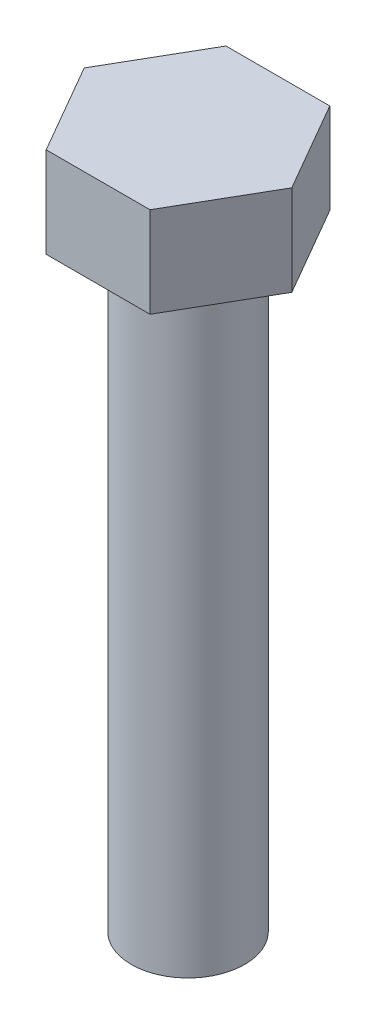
from build123d import *

# Parameters (mm, degrees)
BOSS_EXTRUDE1_DEPTH = 30.3784
SKETCH2_R           = 19.05
BOSS_EXTRUDE2_DEPTH = 203.2


with BuildPart() as part:
    # Sketch3 → Boss-Extrude1 (new body)
    with BuildSketch(Plane(origin=(0, 0, 0), x_dir=(1, 0, 0), z_dir=(0, 1, 0))):
        Polygon((17.414327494, -30.1625), (34.828654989, 0), (17.414327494, 30.1625), (-17.414327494, 30.1625), (-34.828654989, 0), (-17.414327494, -30.1625), align=None)
    extrude(amount=BOSS_EXTRUDE1_DEPTH)

    # Sketch2 → Boss-Extrude2 (add)
    with BuildSketch(Plane(origin=(0, 0, 0), x_dir=(1, 0, 0), z_dir=(0, 1, 0))):
        with Locations(Location((0, 0, 0), (0, 0, 270))):
            Circle(SKETCH2_R)
    extrude(amount=-BOSS_EXTRUDE2_DEPTH)


solid = part.part
